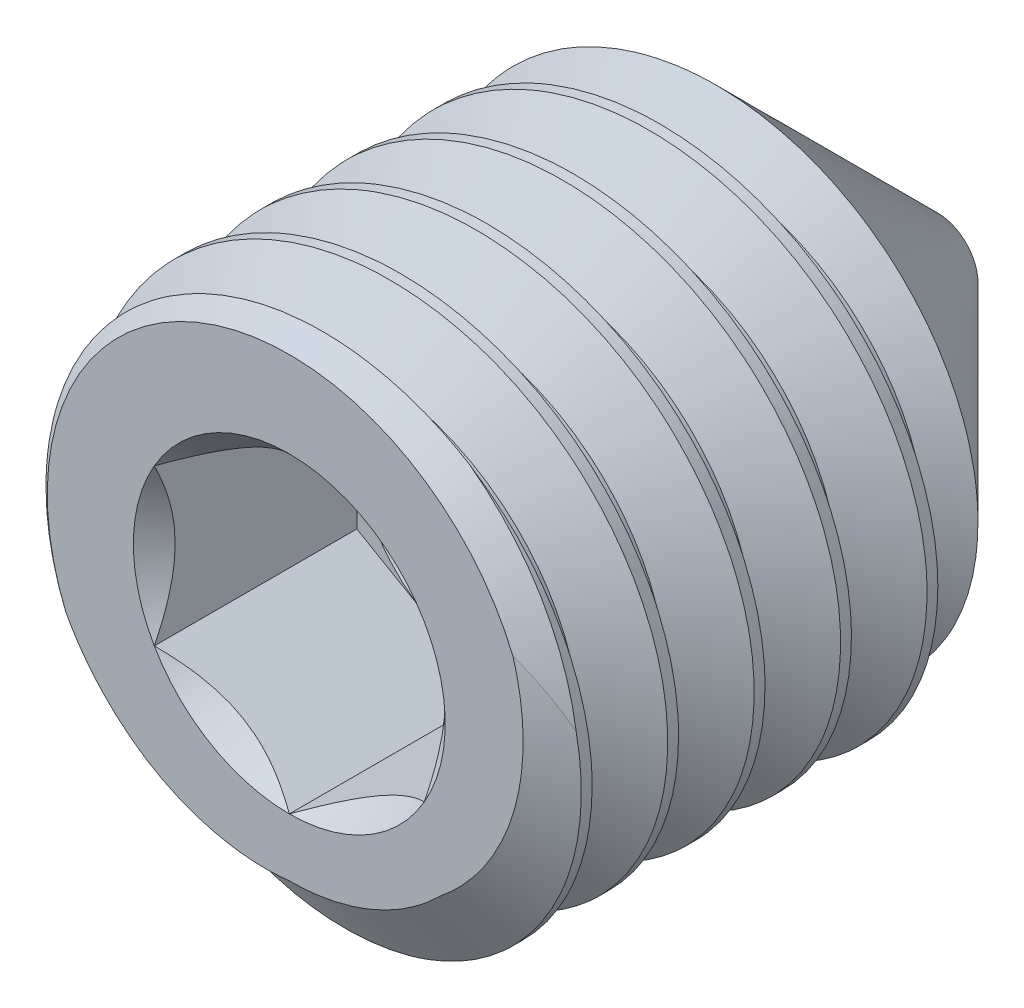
from build123d import *

# Parameters (mm, degrees)
CUT_EXTRUDE1_DEPTH     = 1.875
CUT_SWEEP1_PITCH       = 0.8
CUT_SWEEP1_HEIGHT      = 6.8
CUT_SWEEP1_RADIUS      = 2.5
CUT_SWEEP1_START_ANGLE = 90


with BuildPart() as part:
    # Sketch2 → Revolve1 (revolve)
    with BuildSketch(Plane(origin=(0, 0, 0), x_dir=(0, 0, -1), z_dir=(1, 0, 0))):
        Polygon((-3, 2.240192), (-2.818081, 2.5), (0.875, 2.5), (3, 0.375), (3, 0), (-3, 0), align=None)
    revolve(axis=Axis((0, 0, -3), (0, 0, 1)))

    # Sketch3 → Cut-Extrude1 (cut)
    with BuildSketch(Plane.XY.offset(3)):
        Polygon((0, 1.443376), (-1.25, 0.721688), (-1.25, -0.721688), (0, -1.443376), (1.25, -0.721688), (1.25, 0.721688), align=None)
    extrude(amount=-CUT_EXTRUDE1_DEPTH, mode=Mode.SUBTRACT)

    # Cut-Extrude2 cone 1 section (on through the dimple's axis) → Cut-Extrude2 (revolve, cut)
    with BuildSketch(Plane(origin=(0, 0, 3), x_dir=(0, -1, 0), z_dir=(1, 0, 0))):
        Polygon((0, 0), (1.443376, 0), (0, 1.443376), align=None)
    revolve(axis=Axis((0, 0, 3), (0, 0, -1)), mode=Mode.SUBTRACT)

    # Cut-Extrude3 cone 1 section (on through the dimple's axis) → Cut-Extrude3 (revolve, cut)
    with BuildSketch(Plane(origin=(0, 0, 1.125), x_dir=(0, -1, 0), z_dir=(1, 0, 0))):
        Polygon((0, 0), (1.25, 0), (0, 1.25), align=None)
    revolve(axis=Axis((0, 0, 1.125), (0, 0, -1)), mode=Mode.SUBTRACT)

    # Cut-Sweep1: sweep along a helix
    with BuildLine() as cut_sweep1_path:
        add(Helix(CUT_SWEEP1_PITCH, CUT_SWEEP1_HEIGHT, CUT_SWEEP1_RADIUS, center=(0, 0, 3), direction=(0, 0, -1), mode=Mode.PRIVATE).rotate(Axis((0, 0, 3), (0, 0, -1)), CUT_SWEEP1_START_ANGLE))
    with BuildLine() as cut_sweep1_axis:
        Line((0, 0, 3), (0, 0, -3.8))
    # Sketch7 → Cut-Sweep1 (sweep, cut)
    with BuildSketch(Plane(origin=(0, 0, 0), x_dir=(0, 0, -1), z_dir=(1, 0, 0))):
        Polygon((-3.725, 2.543301), (-2.975, 2.543301), (-3.3, 1.980385), (-3.4, 1.980385), align=None)
    sweep(path=cut_sweep1_path.line, binormal=cut_sweep1_axis.edges()[0], mode=Mode.SUBTRACT)


solid = part.part
